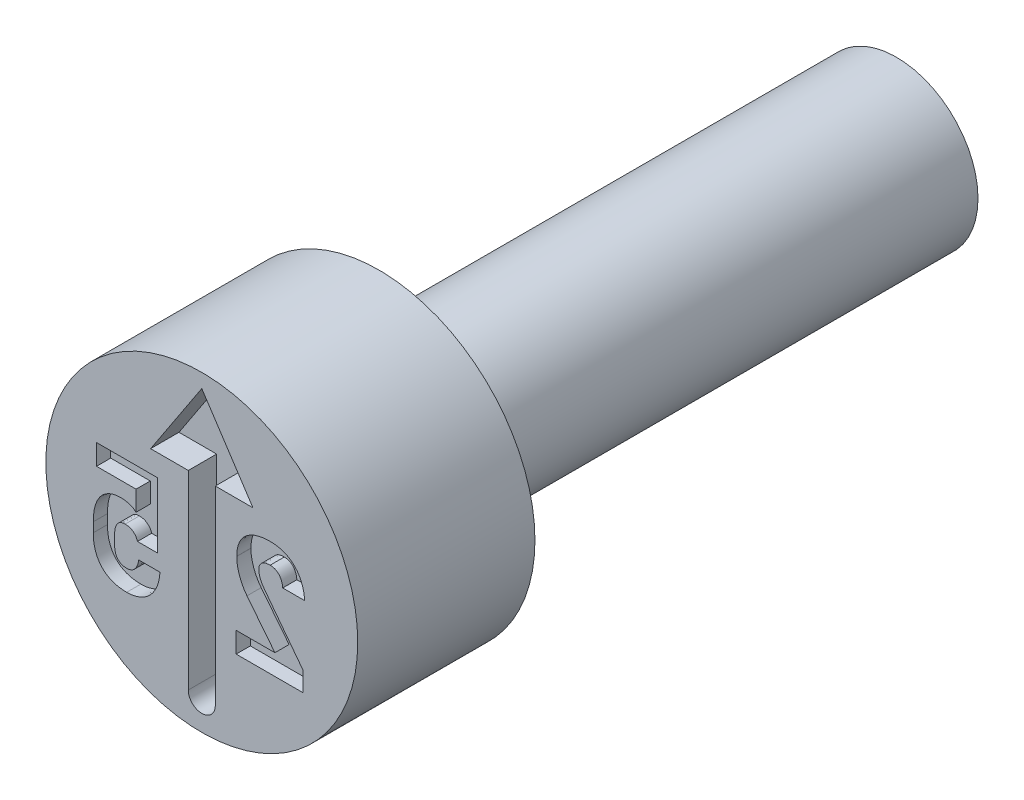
from build123d import *

# Parameters (mm, degrees)
CUT_EXTRUDE4_DEPTH = 0.4
CUT_EXTRUDE5_DEPTH = 0.2


with BuildPart() as part:
    # Sketch2 → Revolve1 (revolve)
    with BuildSketch(Plane(origin=(0, 0, 0), x_dir=(0, 0, -1), z_dir=(1, 0, 0)), mode=Mode.PRIVATE) as revolve1_sk:
        Polygon((0, 2.2), (0, 0), (9.8, 0), (9.8, 1.15), (2.5, 1.15), (2.5, 2.2), align=None)
    revolve(revolve1_sk.sketch.rotate(Axis((0, 0, -0.403888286), (0, 0, -1)), 90), axis=Axis((0, 0, -0.403888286), (0, 0, -1)))

    # Sketch3 → Cut-Extrude4 (cut)
    with BuildSketch(Plane.XY):
        with BuildLine():
            Line((0.190473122, 0.906351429), (0.190473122, -1.776161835))
            ThreePointArc((0.190473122, -1.776161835), (0, -1.966634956), (-0.190473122, -1.776161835))
            Line((-0.190473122, -1.776161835), (-0.190473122, 0.906351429))
            Line((-0.190473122, 0.906351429), (-0.721917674, 0.906351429))
            Line((-0.721917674, 0.906351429), (0, 2.002115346))
            Line((0, 2.002115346), (0.721917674, 0.906351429))
            Line((0.721917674, 0.906351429), (0.190473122, 0.906351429))
        make_face()
    extrude(amount=-CUT_EXTRUDE4_DEPTH, mode=Mode.SUBTRACT)

    # Sketch4 → Cut-Extrude5 (cut)
    with BuildSketch(Plane.XY):
        with BuildLine():
            Line((1.430986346, -0.728061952), (0.881893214, -0.006154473))
            add(Edge.make_bspline(
                [(0.881893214, -0.006154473), (0.87037724, 0.009822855), (0.847895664, 0.041013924), (0.8277816, 0.084035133), (0.815003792, 0.117768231), (0.809096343, 0.142237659), (0.804723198, 0.165635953), (0.804213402, 0.180987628), (0.803963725, 0.188506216)],
                knots=[0, 0, 0, 0, 1.660423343, 3.241491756, 3.993801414, 4.704207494, 5.365376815, 6, 6, 6, 6], degree=3))
            Line((0.803963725, 0.188506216), (0.803963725, 0.190788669))
            add(Edge.make_bspline(
                [(0.803963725, 0.190788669), (0.804401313, 0.201062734), (0.805235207, 0.220641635), (0.813285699, 0.248187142), (0.826598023, 0.27200648), (0.84524498, 0.291973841), (0.868964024, 0.30731968), (0.89694214, 0.318529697), (0.929328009, 0.324872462), (0.952295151, 0.325680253), (0.96438761, 0.326105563)],
                knots=[0, 0, 0, 0, 1.033361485, 1.969238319, 2.861873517, 3.760870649, 4.693536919, 5.686153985, 6.781734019, 8, 8, 8, 8], degree=3))
            add(Edge.make_bspline(
                [(0.96438761, 0.326105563), (0.976295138, 0.325602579), (0.999403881, 0.324626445), (1.032276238, 0.315324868), (1.061477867, 0.299533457), (1.086756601, 0.27770935), (1.107967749, 0.25025458), (1.123601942, 0.217180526), (1.136192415, 0.179590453), (1.139846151, 0.152308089), (1.141766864, 0.137966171)],
                knots=[0, 0, 0, 0, 0.993701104, 1.928459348, 2.826878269, 3.748294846, 4.700551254, 5.70417143, 6.793118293, 8, 8, 8, 8], degree=3))
            Line((1.141766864, 0.137966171), (1.141766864, 0.136661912))
            Line((1.141766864, 0.136661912), (1.450876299, 0.136661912))
            Line((1.450876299, 0.136661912), (1.450876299, 0.137966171))
            add(Edge.make_bspline(
                [(1.450876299, 0.137966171), (1.448661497, 0.162053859), (1.444346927, 0.208978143), (1.429676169, 0.276459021), (1.408003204, 0.338551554), (1.380312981, 0.395427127), (1.346359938, 0.446367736), (1.306964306, 0.49135965), (1.261689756, 0.529528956), (1.211320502, 0.561246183), (1.156076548, 0.586068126), (1.096633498, 0.604153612), (1.032901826, 0.614579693), (0.989097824, 0.615935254), (0.966670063, 0.616629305)],
                knots=[0, 0, 0, 0, 1.143950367, 2.228484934, 3.258162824, 4.249580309, 5.213917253, 6.146796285, 7.070112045, 8.006232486, 8.954636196, 9.927630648, 10.9389416, 12, 12, 12, 12], degree=3))
            add(Edge.make_bspline(
                [(0.966670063, 0.616629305), (0.942620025, 0.616126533), (0.896072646, 0.615153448), (0.829047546, 0.605992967), (0.767416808, 0.590748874), (0.711335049, 0.569331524), (0.661170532, 0.541800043), (0.616691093, 0.509120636), (0.579152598, 0.470024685), (0.547927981, 0.425611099), (0.523313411, 0.37605126), (0.506075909, 0.321387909), (0.49551955, 0.262060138), (0.494219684, 0.220831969), (0.493550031, 0.199592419)],
                knots=[0, 0, 0, 0, 1.208591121, 2.339154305, 3.392741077, 4.394302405, 5.348037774, 6.261656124, 7.158186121, 8.060194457, 8.981460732, 9.928425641, 10.932785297, 12, 12, 12, 12], degree=3))
            Line((0.493550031, 0.199592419), (0.493550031, 0.19828816))
            add(Edge.make_bspline(
                [(0.493550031, 0.19828816), (0.493968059, 0.180114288), (0.494804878, 0.143733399), (0.502268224, 0.0893815), (0.514471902, 0.035343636), (0.53103065, -0.018190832), (0.551707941, -0.070327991), (0.576384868, -0.120237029), (0.604558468, -0.167790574), (0.626634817, -0.197199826), (0.637670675, -0.211901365)],
                knots=[0, 0, 0, 0, 0.985191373, 1.972179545, 2.968870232, 3.986806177, 5.007996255, 6.007036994, 7.003727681, 8, 8, 8, 8], degree=3))
            Line((0.637670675, -0.211901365), (1.031556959, -0.709476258))
            Line((1.031556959, -0.709476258), (0.484746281, -0.709476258))
            Line((0.484746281, -0.709476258), (0.484746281, -1))
            Line((0.484746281, -1), (1.430986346, -1))
            Line((1.430986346, -1), (1.430986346, -0.728061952))
        make_face()
        with BuildLine():
            add(Edge.make_bspline(
                [(-1.05910536, -1.016629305), (-1.038076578, -1.015987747), (-0.996926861, -1.014732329), (-0.936945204, -1.003462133), (-0.880080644, -0.986008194), (-0.826756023, -0.96110896), (-0.777550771, -0.929475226), (-0.733552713, -0.890792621), (-0.694358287, -0.846073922), (-0.660753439, -0.794927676), (-0.633078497, -0.737901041), (-0.611533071, -0.675666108), (-0.596734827, -0.608334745), (-0.592432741, -0.561621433), (-0.59022417, -0.537640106)],
                knots=[0, 0, 0, 0, 1.013165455, 1.982590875, 2.932437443, 3.87502652, 4.811241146, 5.743574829, 6.690699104, 7.67044025, 8.68537997, 9.739549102, 10.839546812, 12, 12, 12, 12], degree=3))
            Line((-0.59022417, -0.537640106), (-0.891834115, -0.536661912))
            add(Edge.make_bspline(
                [(-0.891834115, -0.536661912), (-0.89355592, -0.551644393), (-0.896837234, -0.578332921), (-0.90866967, -0.615368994), (-0.924117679, -0.647923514), (-0.944523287, -0.675239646), (-0.968755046, -0.697416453), (-0.997468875, -0.712457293), (-1.029203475, -0.722493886), (-1.051742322, -0.723371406), (-1.063344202, -0.72382311)],
                knots=[0, 0, 0, 0, 1.202223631, 2.291125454, 3.30376979, 4.265156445, 5.185306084, 6.082185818, 7.012804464, 8, 8, 8, 8], degree=3))
            add(Edge.make_bspline(
                [(-1.063344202, -0.72382311), (-1.075919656, -0.723275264), (-1.09997324, -0.722227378), (-1.133688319, -0.712113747), (-1.16303857, -0.695921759), (-1.187281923, -0.672622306), (-1.206621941, -0.643591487), (-1.220311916, -0.608826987), (-1.228419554, -0.568880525), (-1.229217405, -0.540506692), (-1.229637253, -0.525575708)],
                knots=[0, 0, 0, 0, 1.026088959, 1.96264217, 2.850204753, 3.743092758, 4.68486217, 5.681854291, 6.780136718, 8, 8, 8, 8], degree=3))
            Line((-1.229637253, -0.525575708), (-1.229637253, -0.391563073))
            add(Edge.make_bspline(
                [(-1.229637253, -0.391563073), (-1.229315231, -0.376633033), (-1.228704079, -0.348297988), (-1.221101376, -0.308661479), (-1.209280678, -0.274079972), (-1.191823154, -0.245372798), (-1.170121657, -0.222201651), (-1.143860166, -0.20574461), (-1.113566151, -0.19602488), (-1.092111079, -0.194886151), (-1.080951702, -0.194293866)],
                knots=[0, 0, 0, 0, 1.281587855, 2.432267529, 3.454745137, 4.406485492, 5.298532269, 6.159104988, 7.042499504, 8, 8, 8, 8], degree=3))
            add(Edge.make_bspline(
                [(-1.080951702, -0.194293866), (-1.070483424, -0.194613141), (-1.050217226, -0.195231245), (-1.021037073, -0.20163139), (-0.994217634, -0.212102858), (-0.97006336, -0.226907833), (-0.948729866, -0.245053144), (-0.931165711, -0.266978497), (-0.916441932, -0.291752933), (-0.910298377, -0.310334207), (-0.90715916, -0.319828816)],
                knots=[0, 0, 0, 0, 1.085085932, 2.100686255, 3.083167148, 4.060192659, 5.028057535, 5.974180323, 6.964852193, 8, 8, 8, 8], degree=3))
            Line((-0.90715916, -0.319828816), (-0.625439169, -0.319828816))
            Line((-0.625439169, -0.319828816), (-0.625439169, 0.6))
            Line((-0.625439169, 0.6), (-1.484945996, 0.6))
            Line((-1.484945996, 0.6), (-1.484945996, 0.309476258))
            Line((-1.484945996, 0.309476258), (-0.927049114, 0.309476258))
            Line((-0.927049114, 0.309476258), (-0.927049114, 0.026778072))
            add(Edge.make_bspline(
                [(-0.927049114, 0.026778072), (-0.933119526, 0.032153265), (-0.94560684, 0.043210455), (-0.967438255, 0.057250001), (-0.992406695, 0.069174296), (-1.029249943, 0.082907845), (-1.077715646, 0.095120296), (-1.117502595, 0.097176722), (-1.137034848, 0.098186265)],
                knots=[0, 0, 0, 0, 0.643749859, 1.324243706, 2.054464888, 2.839075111, 4.448235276, 6, 6, 6, 6], degree=3))
            add(Edge.make_bspline(
                [(-1.137034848, 0.098186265), (-1.157087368, 0.097551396), (-1.195978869, 0.096320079), (-1.252076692, 0.085244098), (-1.303776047, 0.067499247), (-1.350650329, 0.041934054), (-1.39275256, 0.009891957), (-1.429321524, -0.029260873), (-1.460585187, -0.074886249), (-1.486171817, -0.127014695), (-1.506309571, -0.185189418), (-1.520936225, -0.249004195), (-1.52927162, -0.318520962), (-1.53035854, -0.366650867), (-1.530921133, -0.391563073)],
                knots=[0, 0, 0, 0, 1.012739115, 1.964189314, 2.878178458, 3.765675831, 4.65138573, 5.541464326, 6.461953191, 7.437418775, 8.467828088, 9.567356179, 10.740855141, 12, 12, 12, 12], degree=3))
            Line((-1.530921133, -0.391563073), (-1.530921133, -0.525575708))
            add(Edge.make_bspline(
                [(-1.530921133, -0.525575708), (-1.530206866, -0.550495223), (-1.528825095, -0.598702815), (-1.518943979, -0.668414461), (-1.501131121, -0.732360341), (-1.477264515, -0.790953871), (-1.446099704, -0.843030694), (-1.408781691, -0.889030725), (-1.36462946, -0.927891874), (-1.31468503, -0.960596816), (-1.25847318, -0.985679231), (-1.196892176, -1.003900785), (-1.129698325, -1.014739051), (-1.083166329, -1.015985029), (-1.05910536, -1.016629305)],
                knots=[0, 0, 0, 0, 1.159103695, 2.242322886, 3.265299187, 4.239894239, 5.17631577, 6.078070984, 6.98412447, 7.901225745, 8.844758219, 9.836512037, 10.881294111, 12, 12, 12, 12], degree=3))
        make_face()
    extrude(amount=-CUT_EXTRUDE5_DEPTH, mode=Mode.SUBTRACT)


solid = part.part
